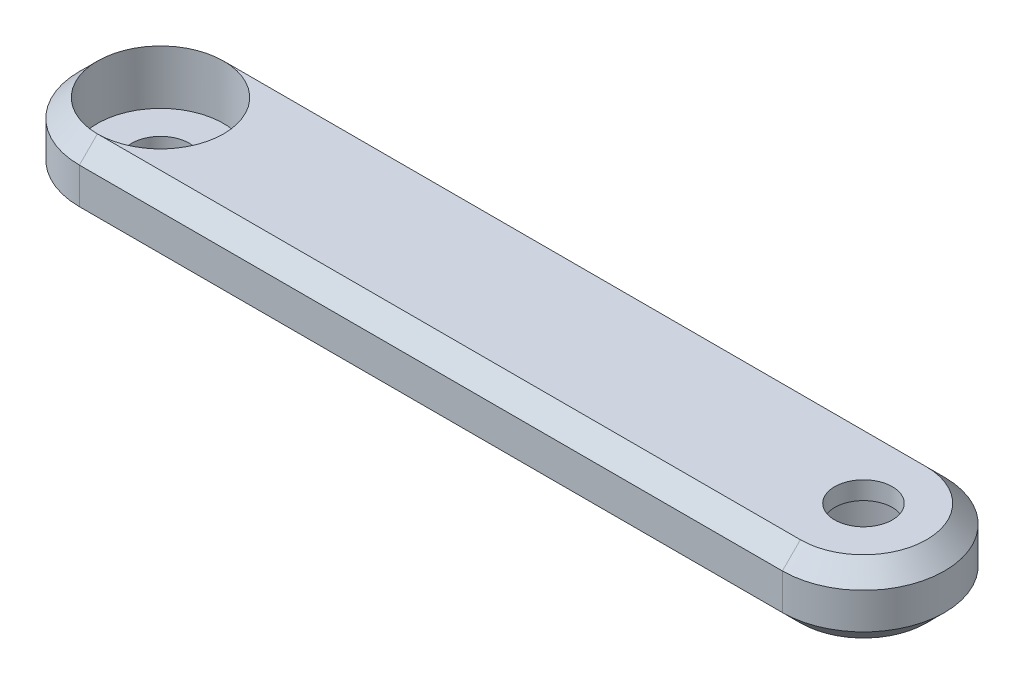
from build123d import *

# Parameters (mm, degrees)
EXTRUDE_1_DEPTH     = 4
SKETCH_2_R          = 1.6
CUT_EXTRUDE_4_DEPTH = 10
CHAMFER_1_SIZE      = 1
EXTRUDE_START       = -4
SKETCH_5_R          = 2.25
SKETCH_5_R_2        = 1.6
EXTRUDE_2_DEPTH     = 4
SKETCH_7_R          = 3.5
CUT_EXTRUDE_6_DEPTH = 3
SKETCH_8_R          = 3.5
CUT_EXTRUDE_7_DEPTH = 3


with BuildPart() as part:
    # Sketch 1 → Extrude 1 (new body)
    with BuildSketch(Plane(origin=(0, 0, 0), x_dir=(1, 0, 0), z_dir=(0, 1, 0))):
        with BuildLine():
            Line((-15.663286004, 5.805273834), (11.336713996, 5.805273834))
            Line((11.336713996, 5.805273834), (23.336713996, 5.805273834))
            ThreePointArc((23.336713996, 5.805273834), (27.836713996, 1.305273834), (23.336713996, -3.194726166))
            Line((23.336713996, -3.194726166), (11.336713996, -3.194726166))
            Line((11.336713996, -3.194726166), (-15.663286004, -3.194726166))
            ThreePointArc((-15.663286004, -3.194726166), (-20.163286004, 1.305273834), (-15.663286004, 5.805273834))
        make_face()
    extrude(amount=EXTRUDE_1_DEPTH)

    # Sketch 2 → Cut-Extrude 4 (cut)
    with BuildSketch(Plane(origin=(0, 4, 0), x_dir=(1, 0, 0), z_dir=(0, 1, 0))):
        with Locations(Location((-15.663286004, 1.305273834, 0), (0, 0, 270))):
            Circle(SKETCH_2_R)
        with Locations(Location((23.336713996, 1.305273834, 0), (0, 0, 270))):
            Circle(SKETCH_2_R)
    extrude(amount=-CUT_EXTRUDE_4_DEPTH, mode=Mode.SUBTRACT)

    # Chamfer 1
    chamfer_1_edges = [part.edges().sort_by_distance(p)[0] for p in [
        (27.836713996, 4, -1.305273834),
        (3.836713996, 4, -5.805273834),
        (-20.163286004, 4, -1.305273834),
        (3.836713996, 0, -5.805273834),
        (27.836713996, 0, -1.305273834),
        (3.836713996, 0, 3.194726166),
        (-20.163286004, 0, -1.305273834),
        (3.836713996, 4, 3.194726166),
    ]]
    chamfer(chamfer_1_edges, length=CHAMFER_1_SIZE)

    # Sketch 5 → Extrude 2 (add)
    with BuildSketch(Plane.XZ.offset(EXTRUDE_START)):
        with Locations((23.336713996, -1.305273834)):
            Circle(SKETCH_5_R)
        with Locations(Location((23.336713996, -1.305273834, 0), (0, 0, 90))):
            Circle(SKETCH_5_R_2, mode=Mode.SUBTRACT)
    extrude(amount=EXTRUDE_2_DEPTH)

    # Sketch 7 → Cut-Extrude 6 (cut)
    with BuildSketch(Plane.XZ):
        with Locations(Location((23.336713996, -1.305273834, 0), (0, 0, 270))):
            Circle(SKETCH_7_R)
    extrude(amount=-CUT_EXTRUDE_6_DEPTH, mode=Mode.SUBTRACT)

    # Sketch 8 → Cut-Extrude 7 (cut)
    with BuildSketch(Plane(origin=(0, 4, 0), x_dir=(1, 0, 0), z_dir=(0, 1, 0))):
        with Locations(Location((-15.663286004, 1.305273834, 0), (0, 0, 270))):
            Circle(SKETCH_8_R)
    extrude(amount=-CUT_EXTRUDE_7_DEPTH, mode=Mode.SUBTRACT)


solid = part.part
